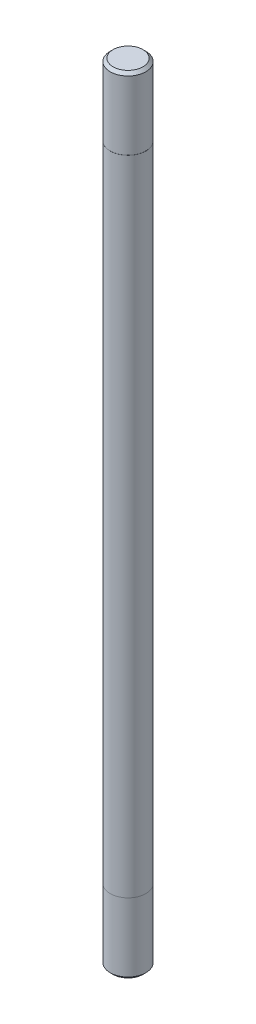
ISO-10303-21;
HEADER;
FILE_DESCRIPTION(('STEP AP214'),'2;1');
FILE_NAME('part.step','',(''),(''),'','','');
FILE_SCHEMA(('AUTOMOTIVE_DESIGN { 1 0 10303 214 1 1 1 1 }'));
ENDSEC;
DATA;
#1=APPLICATION_CONTEXT('core data for automotive mechanical design processes');
#2=APPLICATION_PROTOCOL_DEFINITION('international standard','automotive_design',2000,#1);
#3=PRODUCT_CONTEXT('',#1,'mechanical');
#4=PRODUCT('Part','Part','',(#3));
#5=PRODUCT_RELATED_PRODUCT_CATEGORY('part','',(#4));
#6=PRODUCT_DEFINITION_FORMATION('','',#4);
#7=PRODUCT_DEFINITION_CONTEXT('part definition',#1,'design');
#8=PRODUCT_DEFINITION('design','',#6,#7);
#9=PRODUCT_DEFINITION_SHAPE('','',#8);
#10=(LENGTH_UNIT() NAMED_UNIT(*) SI_UNIT(.MILLI.,.METRE.));
#11=(NAMED_UNIT(*) PLANE_ANGLE_UNIT() SI_UNIT($,.RADIAN.));
#12=(NAMED_UNIT(*) SI_UNIT($,.STERADIAN.) SOLID_ANGLE_UNIT());
#13=UNCERTAINTY_MEASURE_WITH_UNIT(LENGTH_MEASURE(1.E-05),#10,'distance_accuracy_value','');
#14=(GEOMETRIC_REPRESENTATION_CONTEXT(3) GLOBAL_UNCERTAINTY_ASSIGNED_CONTEXT((#13)) GLOBAL_UNIT_ASSIGNED_CONTEXT((#10,
#11,#12)) REPRESENTATION_CONTEXT('',''));
#15=CARTESIAN_POINT('',(0.,0.,0.));
#16=DIRECTION('',(0.,0.,1.));
#17=DIRECTION('',(1.,0.,0.));
#18=AXIS2_PLACEMENT_3D('',#15,#16,#17);
#19=CARTESIAN_POINT('',(0.,0.,0.));
#20=DIRECTION('',(0.,1.,0.));
#21=DIRECTION('',(0.,0.,1.));
#22=AXIS2_PLACEMENT_3D('',#19,#20,#21);
#23=PLANE('',#22);
#24=CARTESIAN_POINT('',(0.,0.,0.));
#25=DIRECTION('',(0.,1.,0.));
#26=DIRECTION('',(0.,0.,1.));
#27=AXIS2_PLACEMENT_3D('',#24,#25,#26);
#28=CIRCLE('',#27,2.5);
#29=CARTESIAN_POINT('',(0.,0.,-2.5));
#30=VERTEX_POINT('',#29);
#31=EDGE_CURVE('E56',#30,#30,#28,.T.);
#32=ORIENTED_EDGE('',*,*,#31,.F.);
#33=EDGE_LOOP('',(#32));
#34=FACE_BOUND('',#33,.T.);
#35=CARTESIAN_POINT('',(0.,0.,0.));
#36=DIRECTION('',(0.,1.,0.));
#37=DIRECTION('',(0.,0.,1.));
#38=AXIS2_PLACEMENT_3D('',#35,#36,#37);
#39=CIRCLE('',#38,2.49);
#40=CARTESIAN_POINT('',(0.,0.,2.49));
#41=VERTEX_POINT('',#40);
#42=EDGE_CURVE('E50',#41,#41,#39,.F.);
#43=ORIENTED_EDGE('',*,*,#42,.F.);
#44=EDGE_LOOP('',(#43));
#45=FACE_BOUND('',#44,.T.);
#46=ADVANCED_FACE('F30',(#34,#45),#23,.F.);
#47=CARTESIAN_POINT('',(0.,90.,0.));
#48=DIRECTION('',(0.,1.,0.));
#49=DIRECTION('',(0.,0.,1.));
#50=AXIS2_PLACEMENT_3D('',#47,#48,#49);
#51=PLANE('',#50);
#52=CARTESIAN_POINT('',(0.,90.,0.));
#53=DIRECTION('',(0.,1.,0.));
#54=DIRECTION('',(0.,0.,1.));
#55=AXIS2_PLACEMENT_3D('',#52,#53,#54);
#56=CIRCLE('',#55,2.5);
#57=CARTESIAN_POINT('',(0.,90.,-2.5));
#58=VERTEX_POINT('',#57);
#59=EDGE_CURVE('E53',#58,#58,#56,.T.);
#60=ORIENTED_EDGE('',*,*,#59,.T.);
#61=EDGE_LOOP('',(#60));
#62=FACE_BOUND('',#61,.T.);
#63=CARTESIAN_POINT('',(0.,90.,0.));
#64=DIRECTION('',(0.,1.,0.));
#65=DIRECTION('',(0.,0.,1.));
#66=AXIS2_PLACEMENT_3D('',#63,#64,#65);
#67=CIRCLE('',#66,2.49);
#68=CARTESIAN_POINT('',(0.,90.,2.49));
#69=VERTEX_POINT('',#68);
#70=EDGE_CURVE('E59',#69,#69,#67,.T.);
#71=ORIENTED_EDGE('',*,*,#70,.F.);
#72=EDGE_LOOP('',(#71));
#73=FACE_BOUND('',#72,.T.);
#74=ADVANCED_FACE('F65',(#62,#73),#51,.T.);
#75=CARTESIAN_POINT('',(0.,90.,0.));
#76=DIRECTION('',(0.,-1.,0.));
#77=DIRECTION('',(0.,0.,-1.));
#78=AXIS2_PLACEMENT_3D('',#75,#76,#77);
#79=CYLINDRICAL_SURFACE('',#78,2.5);
#80=CARTESIAN_POINT('',(0.,90.,-2.5));
#81=CARTESIAN_POINT('',(0.,89.0625,-2.5));
#82=CARTESIAN_POINT('',(0.,88.125,-2.5));
#83=CARTESIAN_POINT('',(0.,86.25,-2.5));
#84=CARTESIAN_POINT('',(0.,85.3125,-2.5));
#85=CARTESIAN_POINT('',(0.,83.4375,-2.5));
#86=CARTESIAN_POINT('',(0.,82.5,-2.5));
#87=CARTESIAN_POINT('',(0.,80.625,-2.5));
#88=CARTESIAN_POINT('',(0.,79.6875,-2.5));
#89=CARTESIAN_POINT('',(0.,77.8125,-2.5));
#90=CARTESIAN_POINT('',(0.,76.875,-2.5));
#91=CARTESIAN_POINT('',(0.,75.,-2.5));
#92=CARTESIAN_POINT('',(0.,74.0625,-2.5));
#93=CARTESIAN_POINT('',(0.,72.1875,-2.5));
#94=CARTESIAN_POINT('',(0.,71.25,-2.5));
#95=CARTESIAN_POINT('',(0.,69.375,-2.5));
#96=CARTESIAN_POINT('',(0.,68.4375,-2.5));
#97=CARTESIAN_POINT('',(0.,66.5625,-2.5));
#98=CARTESIAN_POINT('',(0.,65.625,-2.5));
#99=CARTESIAN_POINT('',(0.,63.75,-2.5));
#100=CARTESIAN_POINT('',(0.,62.8125,-2.5));
#101=CARTESIAN_POINT('',(0.,60.9375,-2.5));
#102=CARTESIAN_POINT('',(0.,60.,-2.5));
#103=CARTESIAN_POINT('',(0.,58.125,-2.5));
#104=CARTESIAN_POINT('',(0.,57.1875,-2.5));
#105=CARTESIAN_POINT('',(0.,55.3125,-2.5));
#106=CARTESIAN_POINT('',(0.,54.375,-2.5));
#107=CARTESIAN_POINT('',(0.,52.5,-2.5));
#108=CARTESIAN_POINT('',(0.,51.5625,-2.5));
#109=CARTESIAN_POINT('',(0.,49.6875,-2.5));
#110=CARTESIAN_POINT('',(0.,48.75,-2.5));
#111=CARTESIAN_POINT('',(0.,46.875,-2.5));
#112=CARTESIAN_POINT('',(0.,45.9375,-2.5));
#113=CARTESIAN_POINT('',(0.,44.0625,-2.5));
#114=CARTESIAN_POINT('',(0.,43.125,-2.5));
#115=CARTESIAN_POINT('',(0.,41.25,-2.5));
#116=CARTESIAN_POINT('',(0.,40.3125,-2.5));
#117=CARTESIAN_POINT('',(0.,38.4375,-2.5));
#118=CARTESIAN_POINT('',(0.,37.5,-2.5));
#119=CARTESIAN_POINT('',(0.,35.625,-2.5));
#120=CARTESIAN_POINT('',(0.,34.6875,-2.5));
#121=CARTESIAN_POINT('',(0.,32.8125,-2.5));
#122=CARTESIAN_POINT('',(0.,31.875,-2.5));
#123=CARTESIAN_POINT('',(0.,30.,-2.5));
#124=CARTESIAN_POINT('',(0.,29.0625,-2.5));
#125=CARTESIAN_POINT('',(0.,27.1875,-2.5));
#126=CARTESIAN_POINT('',(0.,26.25,-2.5));
#127=CARTESIAN_POINT('',(0.,24.375,-2.5));
#128=CARTESIAN_POINT('',(0.,23.4375,-2.5));
#129=CARTESIAN_POINT('',(0.,21.5625,-2.5));
#130=CARTESIAN_POINT('',(0.,20.625,-2.5));
#131=CARTESIAN_POINT('',(0.,18.75,-2.5));
#132=CARTESIAN_POINT('',(0.,17.8125,-2.5));
#133=CARTESIAN_POINT('',(0.,15.9375,-2.5));
#134=CARTESIAN_POINT('',(0.,15.,-2.5));
#135=CARTESIAN_POINT('',(0.,13.125,-2.5));
#136=CARTESIAN_POINT('',(0.,12.1875,-2.5));
#137=CARTESIAN_POINT('',(0.,10.3125,-2.5));
#138=CARTESIAN_POINT('',(0.,9.37499999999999,-2.5));
#139=CARTESIAN_POINT('',(0.,7.49999999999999,-2.5));
#140=CARTESIAN_POINT('',(0.,6.56249999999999,-2.5));
#141=CARTESIAN_POINT('',(0.,4.68749999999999,-2.5));
#142=CARTESIAN_POINT('',(0.,3.74999999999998,-2.5));
#143=CARTESIAN_POINT('',(0.,1.87499999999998,-2.5));
#144=CARTESIAN_POINT('',(0.,0.937499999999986,-2.5));
#145=CARTESIAN_POINT('',(0.,0.,-2.5));
#146=B_SPLINE_CURVE_WITH_KNOTS('',3,(#80,#81,#82,#83,#84,#85,#86,#87,#88,#89,#90,#91,#92,#93,
#94,#95,#96,#97,#98,#99,#100,#101,#102,#103,#104,#105,#106,#107,#108,#109,#110,#111,#112,#113,
#114,#115,#116,#117,#118,#119,#120,#121,#122,#123,#124,#125,#126,#127,#128,#129,#130,#131,#132,
#133,#134,#135,#136,#137,#138,#139,#140,#141,#142,#143,#144,#145),.UNSPECIFIED.,.F.,.F.,(4,2,2,
2,2,2,2,2,2,2,2,2,2,2,2,2,2,2,2,2,2,2,2,2,2,2,2,2,2,2,2,2,4),(0.,2.81250000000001,
5.62500000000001,8.43750000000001,11.25,14.0625,16.875,19.6875,22.5,25.3125,28.125,30.9375,
33.75,36.5625,39.375,42.1875,45.,47.8125,50.625,53.4375,56.25,59.0625,61.875,64.6875,67.5,
70.3125,73.125,75.9375,78.75,81.5625,84.375,87.1875,90.),.UNSPECIFIED.);
#147=EDGE_CURVE('BSEAM32',#58,#30,#146,.T.);
#148=ORIENTED_EDGE('',*,*,#59,.F.);
#149=ORIENTED_EDGE('',*,*,#31,.T.);
#150=ORIENTED_EDGE('',*,*,#147,.T.);
#151=ORIENTED_EDGE('',*,*,#147,.F.);
#152=EDGE_LOOP('',(#148,#150,#149,#151));
#153=FACE_BOUND('',#152,.T.);
#154=ADVANCED_FACE('F32',(#153),#79,.T.);
#155=CARTESIAN_POINT('',(0.,100.,0.));
#156=DIRECTION('',(0.,-1.,0.));
#157=DIRECTION('',(0.,0.,-1.));
#158=AXIS2_PLACEMENT_3D('',#155,#156,#157);
#159=CYLINDRICAL_SURFACE('',#158,2.49);
#160=CARTESIAN_POINT('',(0.,99.6,0.));
#161=DIRECTION('',(0.,1.,0.));
#162=DIRECTION('',(0.,0.,1.));
#163=AXIS2_PLACEMENT_3D('',#160,#161,#162);
#164=CIRCLE('',#163,2.49);
#165=CARTESIAN_POINT('',(0.,99.6,2.49));
#166=VERTEX_POINT('',#165);
#167=EDGE_CURVE('E41',#166,#166,#164,.F.);
#168=ORIENTED_EDGE('',*,*,#167,.T.);
#169=EDGE_LOOP('',(#168));
#170=FACE_BOUND('',#169,.T.);
#171=ORIENTED_EDGE('',*,*,#70,.T.);
#172=EDGE_LOOP('',(#171));
#173=FACE_BOUND('',#172,.T.);
#174=ADVANCED_FACE('F63',(#170,#173),#159,.T.);
#175=CARTESIAN_POINT('',(0.,100.,0.));
#176=DIRECTION('',(0.,1.,0.));
#177=DIRECTION('',(0.,0.,1.));
#178=AXIS2_PLACEMENT_3D('',#175,#176,#177);
#179=PLANE('',#178);
#180=CARTESIAN_POINT('',(0.,100.,0.));
#181=DIRECTION('',(0.,1.,0.));
#182=DIRECTION('',(0.,0.,1.));
#183=AXIS2_PLACEMENT_3D('',#180,#181,#182);
#184=CIRCLE('',#183,2.09000000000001);
#185=CARTESIAN_POINT('',(0.,100.,2.09000000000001));
#186=VERTEX_POINT('',#185);
#187=EDGE_CURVE('E45',#186,#186,#184,.T.);
#188=ORIENTED_EDGE('',*,*,#187,.T.);
#189=EDGE_LOOP('',(#188));
#190=FACE_BOUND('',#189,.T.);
#191=ADVANCED_FACE('F78',(#190),#179,.T.);
#192=CARTESIAN_POINT('',(0.,-10.,0.));
#193=DIRECTION('',(0.,1.,0.));
#194=DIRECTION('',(0.,0.,1.));
#195=AXIS2_PLACEMENT_3D('',#192,#193,#194);
#196=CYLINDRICAL_SURFACE('',#195,2.49);
#197=CARTESIAN_POINT('',(0.,-9.6,0.));
#198=DIRECTION('',(0.,-1.,0.));
#199=DIRECTION('',(0.,0.,-1.));
#200=AXIS2_PLACEMENT_3D('',#197,#198,#199);
#201=CIRCLE('',#200,2.49);
#202=CARTESIAN_POINT('',(0.,-9.6,2.49));
#203=VERTEX_POINT('',#202);
#204=EDGE_CURVE('E10',#203,#203,#201,.F.);
#205=ORIENTED_EDGE('',*,*,#204,.T.);
#206=EDGE_LOOP('',(#205));
#207=FACE_BOUND('',#206,.T.);
#208=ORIENTED_EDGE('',*,*,#42,.T.);
#209=EDGE_LOOP('',(#208));
#210=FACE_BOUND('',#209,.T.);
#211=ADVANCED_FACE('F82',(#207,#210),#196,.T.);
#212=CARTESIAN_POINT('',(0.,-10.,0.));
#213=DIRECTION('',(0.,-1.,0.));
#214=DIRECTION('',(0.,0.,-1.));
#215=AXIS2_PLACEMENT_3D('',#212,#213,#214);
#216=PLANE('',#215);
#217=CARTESIAN_POINT('',(0.,-10.,0.));
#218=DIRECTION('',(0.,-1.,0.));
#219=DIRECTION('',(0.,0.,-1.));
#220=AXIS2_PLACEMENT_3D('',#217,#218,#219);
#221=CIRCLE('',#220,2.09000000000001);
#222=CARTESIAN_POINT('',(0.,-10.,2.09000000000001));
#223=VERTEX_POINT('',#222);
#224=EDGE_CURVE('E37',#223,#223,#221,.T.);
#225=ORIENTED_EDGE('',*,*,#224,.T.);
#226=EDGE_LOOP('',(#225));
#227=FACE_BOUND('',#226,.T.);
#228=ADVANCED_FACE('F86',(#227),#216,.T.);
#229=CARTESIAN_POINT('',(0.,100.,0.));
#230=DIRECTION('',(0.,-1.,0.));
#231=DIRECTION('',(0.,0.,-1.));
#232=AXIS2_PLACEMENT_3D('',#229,#230,#231);
#233=CONICAL_SURFACE('',#232,2.09000000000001,0.785398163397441);
#234=ORIENTED_EDGE('',*,*,#167,.F.);
#235=EDGE_LOOP('',(#234));
#236=FACE_BOUND('',#235,.T.);
#237=ORIENTED_EDGE('',*,*,#187,.F.);
#238=EDGE_LOOP('',(#237));
#239=FACE_BOUND('',#238,.T.);
#240=ADVANCED_FACE('F89',(#236,#239),#233,.T.);
#241=CARTESIAN_POINT('',(0.,-10.,0.));
#242=DIRECTION('',(0.,1.,0.));
#243=DIRECTION('',(0.,0.,1.));
#244=AXIS2_PLACEMENT_3D('',#241,#242,#243);
#245=CONICAL_SURFACE('',#244,2.09000000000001,0.785398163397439);
#246=CARTESIAN_POINT('',(0.,-9.6,2.49));
#247=CARTESIAN_POINT('',(0.,-9.60416666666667,2.48583333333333));
#248=CARTESIAN_POINT('',(0.,-9.60833333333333,2.48166666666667));
#249=CARTESIAN_POINT('',(0.,-9.61666666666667,2.47333333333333));
#250=CARTESIAN_POINT('',(0.,-9.62083333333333,2.46916666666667));
#251=CARTESIAN_POINT('',(0.,-9.62916666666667,2.46083333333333));
#252=CARTESIAN_POINT('',(0.,-9.63333333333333,2.45666666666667));
#253=CARTESIAN_POINT('',(0.,-9.64166666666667,2.44833333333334));
#254=CARTESIAN_POINT('',(0.,-9.64583333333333,2.44416666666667));
#255=CARTESIAN_POINT('',(0.,-9.65416666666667,2.43583333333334));
#256=CARTESIAN_POINT('',(0.,-9.65833333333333,2.43166666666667));
#257=CARTESIAN_POINT('',(0.,-9.66666666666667,2.42333333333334));
#258=CARTESIAN_POINT('',(0.,-9.67083333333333,2.41916666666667));
#259=CARTESIAN_POINT('',(0.,-9.67916666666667,2.41083333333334));
#260=CARTESIAN_POINT('',(0.,-9.68333333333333,2.40666666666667));
#261=CARTESIAN_POINT('',(0.,-9.69166666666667,2.39833333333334));
#262=CARTESIAN_POINT('',(0.,-9.69583333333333,2.39416666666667));
#263=CARTESIAN_POINT('',(0.,-9.70416666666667,2.38583333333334));
#264=CARTESIAN_POINT('',(0.,-9.70833333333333,2.38166666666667));
#265=CARTESIAN_POINT('',(0.,-9.71666666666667,2.37333333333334));
#266=CARTESIAN_POINT('',(0.,-9.72083333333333,2.36916666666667));
#267=CARTESIAN_POINT('',(0.,-9.72916666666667,2.36083333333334));
#268=CARTESIAN_POINT('',(0.,-9.73333333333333,2.35666666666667));
#269=CARTESIAN_POINT('',(0.,-9.74166666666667,2.34833333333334));
#270=CARTESIAN_POINT('',(0.,-9.74583333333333,2.34416666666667));
#271=CARTESIAN_POINT('',(0.,-9.75416666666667,2.33583333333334));
#272=CARTESIAN_POINT('',(0.,-9.75833333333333,2.33166666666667));
#273=CARTESIAN_POINT('',(0.,-9.76666666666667,2.32333333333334));
#274=CARTESIAN_POINT('',(0.,-9.77083333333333,2.31916666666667));
#275=CARTESIAN_POINT('',(0.,-9.77916666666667,2.31083333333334));
#276=CARTESIAN_POINT('',(0.,-9.78333333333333,2.30666666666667));
#277=CARTESIAN_POINT('',(0.,-9.79166666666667,2.29833333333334));
#278=CARTESIAN_POINT('',(0.,-9.79583333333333,2.29416666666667));
#279=CARTESIAN_POINT('',(0.,-9.80416666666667,2.28583333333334));
#280=CARTESIAN_POINT('',(0.,-9.80833333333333,2.28166666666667));
#281=CARTESIAN_POINT('',(0.,-9.81666666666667,2.27333333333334));
#282=CARTESIAN_POINT('',(0.,-9.82083333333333,2.26916666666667));
#283=CARTESIAN_POINT('',(0.,-9.82916666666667,2.26083333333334));
#284=CARTESIAN_POINT('',(0.,-9.83333333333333,2.25666666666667));
#285=CARTESIAN_POINT('',(0.,-9.84166666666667,2.24833333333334));
#286=CARTESIAN_POINT('',(0.,-9.84583333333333,2.24416666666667));
#287=CARTESIAN_POINT('',(0.,-9.85416666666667,2.23583333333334));
#288=CARTESIAN_POINT('',(0.,-9.85833333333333,2.23166666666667));
#289=CARTESIAN_POINT('',(0.,-9.86666666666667,2.22333333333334));
#290=CARTESIAN_POINT('',(0.,-9.87083333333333,2.21916666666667));
#291=CARTESIAN_POINT('',(0.,-9.87916666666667,2.21083333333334));
#292=CARTESIAN_POINT('',(0.,-9.88333333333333,2.20666666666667));
#293=CARTESIAN_POINT('',(0.,-9.89166666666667,2.19833333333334));
#294=CARTESIAN_POINT('',(0.,-9.89583333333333,2.19416666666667));
#295=CARTESIAN_POINT('',(0.,-9.90416666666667,2.18583333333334));
#296=CARTESIAN_POINT('',(0.,-9.90833333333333,2.18166666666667));
#297=CARTESIAN_POINT('',(0.,-9.91666666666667,2.17333333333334));
#298=CARTESIAN_POINT('',(0.,-9.92083333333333,2.16916666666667));
#299=CARTESIAN_POINT('',(0.,-9.92916666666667,2.16083333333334));
#300=CARTESIAN_POINT('',(0.,-9.93333333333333,2.15666666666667));
#301=CARTESIAN_POINT('',(0.,-9.94166666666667,2.14833333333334));
#302=CARTESIAN_POINT('',(0.,-9.94583333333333,2.14416666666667));
#303=CARTESIAN_POINT('',(0.,-9.95416666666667,2.13583333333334));
#304=CARTESIAN_POINT('',(0.,-9.95833333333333,2.13166666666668));
#305=CARTESIAN_POINT('',(0.,-9.96666666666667,2.12333333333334));
#306=CARTESIAN_POINT('',(0.,-9.97083333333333,2.11916666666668));
#307=CARTESIAN_POINT('',(0.,-9.97916666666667,2.11083333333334));
#308=CARTESIAN_POINT('',(0.,-9.98333333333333,2.10666666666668));
#309=CARTESIAN_POINT('',(0.,-9.99166666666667,2.09833333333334));
#310=CARTESIAN_POINT('',(0.,-9.99583333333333,2.09416666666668));
#311=CARTESIAN_POINT('',(0.,-10.,2.09000000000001));
#312=B_SPLINE_CURVE_WITH_KNOTS('',3,(#246,#247,#248,#249,#250,#251,#252,#253,#254,#255,#256,
#257,#258,#259,#260,#261,#262,#263,#264,#265,#266,#267,#268,#269,#270,#271,#272,#273,#274,#275,
#276,#277,#278,#279,#280,#281,#282,#283,#284,#285,#286,#287,#288,#289,#290,#291,#292,#293,#294,
#295,#296,#297,#298,#299,#300,#301,#302,#303,#304,#305,#306,#307,#308,#309,#310,#311),
.UNSPECIFIED.,.F.,.F.,(4,2,2,2,2,2,2,2,2,2,2,2,2,2,2,2,2,2,2,2,2,2,2,2,2,2,2,2,2,2,2,2,4),(0.,
0.0176776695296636,0.0353553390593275,0.053033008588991,0.0707106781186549,0.0883883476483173,
0.106066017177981,0.123743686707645,0.141421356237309,0.159099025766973,0.176776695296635,
0.194454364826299,0.212132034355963,0.229809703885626,0.247487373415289,0.265165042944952,
0.282842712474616,0.30052038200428,0.318198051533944,0.335875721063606,0.35355339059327,
0.371231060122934,0.388908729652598,0.40658639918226,0.424264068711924,0.441941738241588,
0.459619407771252,0.477297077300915,0.494974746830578,0.512652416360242,0.530330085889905,
0.548007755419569,0.565685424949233),.UNSPECIFIED.);
#313=EDGE_CURVE('BSEAM92',#203,#223,#312,.T.);
#314=ORIENTED_EDGE('',*,*,#204,.F.);
#315=ORIENTED_EDGE('',*,*,#224,.F.);
#316=ORIENTED_EDGE('',*,*,#313,.T.);
#317=ORIENTED_EDGE('',*,*,#313,.F.);
#318=EDGE_LOOP('',(#314,#316,#315,#317));
#319=FACE_BOUND('',#318,.T.);
#320=ADVANCED_FACE('F92',(#319),#245,.T.);
#321=CLOSED_SHELL('',(#46,#74,#154,#174,#191,#211,#228,#240,#320));
#322=MANIFOLD_SOLID_BREP('B2',#321);
#323=ADVANCED_BREP_SHAPE_REPRESENTATION('',(#18,#322),#14);
#324=SHAPE_DEFINITION_REPRESENTATION(#9,#323);
ENDSEC;
END-ISO-10303-21;
